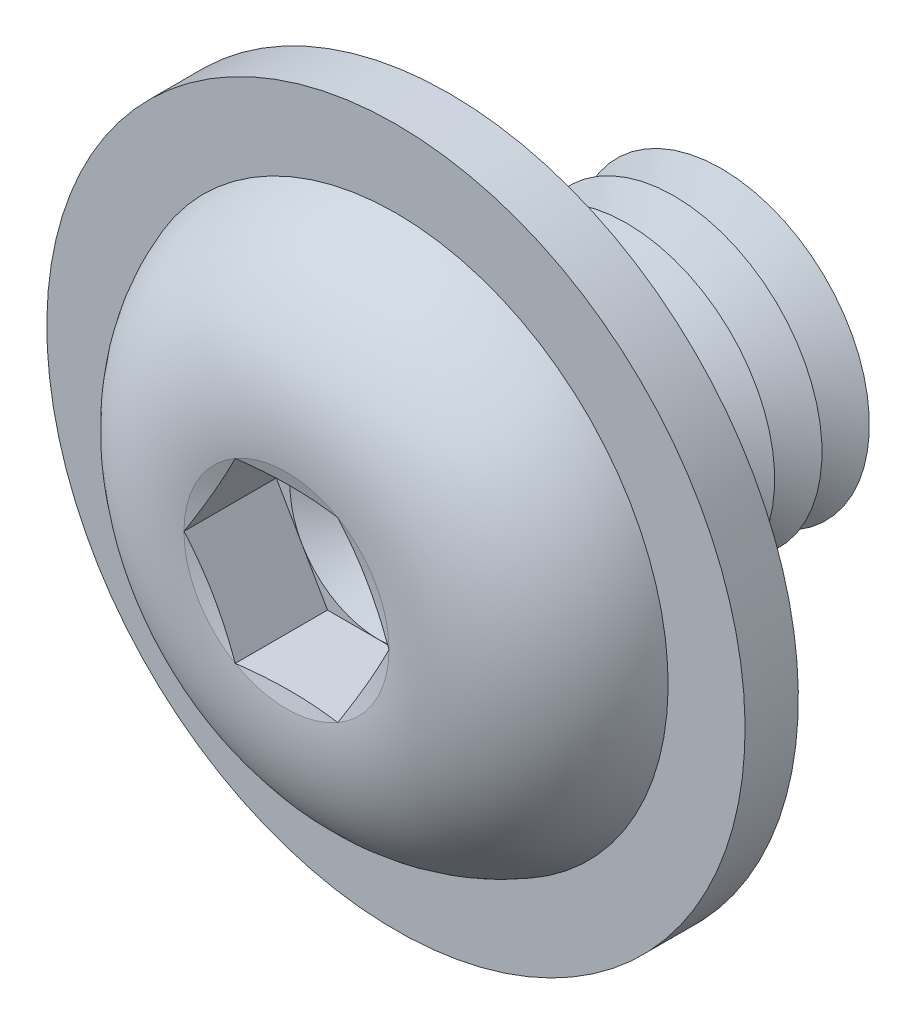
ISO-10303-21;
HEADER;
FILE_DESCRIPTION(('STEP AP214'),'2;1');
FILE_NAME('part.step','',(''),(''),'','','');
FILE_SCHEMA(('AUTOMOTIVE_DESIGN { 1 0 10303 214 1 1 1 1 }'));
ENDSEC;
DATA;
#1=APPLICATION_CONTEXT('core data for automotive mechanical design processes');
#2=APPLICATION_PROTOCOL_DEFINITION('international standard','automotive_design',2000,#1);
#3=PRODUCT_CONTEXT('',#1,'mechanical');
#4=PRODUCT('Part','Part','',(#3));
#5=PRODUCT_RELATED_PRODUCT_CATEGORY('part','',(#4));
#6=PRODUCT_DEFINITION_FORMATION('','',#4);
#7=PRODUCT_DEFINITION_CONTEXT('part definition',#1,'design');
#8=PRODUCT_DEFINITION('design','',#6,#7);
#9=PRODUCT_DEFINITION_SHAPE('','',#8);
#10=(LENGTH_UNIT() NAMED_UNIT(*) SI_UNIT(.MILLI.,.METRE.));
#11=(NAMED_UNIT(*) PLANE_ANGLE_UNIT() SI_UNIT($,.RADIAN.));
#12=(NAMED_UNIT(*) SI_UNIT($,.STERADIAN.) SOLID_ANGLE_UNIT());
#13=UNCERTAINTY_MEASURE_WITH_UNIT(LENGTH_MEASURE(1.E-05),#10,'distance_accuracy_value','');
#14=(GEOMETRIC_REPRESENTATION_CONTEXT(3) GLOBAL_UNCERTAINTY_ASSIGNED_CONTEXT((#13)) GLOBAL_UNIT_ASSIGNED_CONTEXT((#10,
#11,#12)) REPRESENTATION_CONTEXT('',''));
#15=CARTESIAN_POINT('',(0.,0.,0.));
#16=DIRECTION('',(0.,0.,1.));
#17=DIRECTION('',(1.,0.,0.));
#18=AXIS2_PLACEMENT_3D('',#15,#16,#17);
#19=CARTESIAN_POINT('',(0.,0.,-2.19999999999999));
#20=DIRECTION('',(0.,0.,1.));
#21=DIRECTION('',(0.,-1.,0.));
#22=AXIS2_PLACEMENT_3D('',#19,#20,#21);
#23=CONICAL_SURFACE('',#22,2.49999999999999,1.0471975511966);
#24=CARTESIAN_POINT('',(0.,0.,-2.59999999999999));
#25=DIRECTION('',(0.,0.,1.));
#26=DIRECTION('',(0.,-1.,0.));
#27=AXIS2_PLACEMENT_3D('',#24,#25,#26);
#28=CIRCLE('',#27,1.80717967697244);
#29=CARTESIAN_POINT('',(0.,-1.80717967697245,-2.59999999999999));
#30=VERTEX_POINT('',#29);
#31=EDGE_CURVE('E257',#30,#30,#28,.T.);
#32=ORIENTED_EDGE('',*,*,#31,.T.);
#33=EDGE_LOOP('',(#32));
#34=FACE_BOUND('',#33,.T.);
#35=CARTESIAN_POINT('',(0.,0.,-2.2));
#36=DIRECTION('',(0.,0.,1.));
#37=DIRECTION('',(0.,-1.,0.));
#38=AXIS2_PLACEMENT_3D('',#35,#36,#37);
#39=CIRCLE('',#38,2.49999999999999);
#40=CARTESIAN_POINT('',(0.,-2.5,-2.2));
#41=VERTEX_POINT('',#40);
#42=EDGE_CURVE('E253',#41,#41,#39,.T.);
#43=ORIENTED_EDGE('',*,*,#42,.F.);
#44=EDGE_LOOP('',(#43));
#45=FACE_BOUND('',#44,.T.);
#46=ADVANCED_FACE('F39',(#34,#45),#23,.T.);
#47=CARTESIAN_POINT('',(0.,0.,-2.59999999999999));
#48=DIRECTION('',(0.,0.,-1.));
#49=DIRECTION('',(0.,1.,0.));
#50=AXIS2_PLACEMENT_3D('',#47,#48,#49);
#51=CONICAL_SURFACE('',#50,1.80717967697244,1.04719755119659);
#52=CARTESIAN_POINT('',(0.,0.,-3.));
#53=DIRECTION('',(0.,0.,1.));
#54=DIRECTION('',(0.,-1.,0.));
#55=AXIS2_PLACEMENT_3D('',#52,#53,#54);
#56=CIRCLE('',#55,2.49999999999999);
#57=CARTESIAN_POINT('',(0.,-2.5,-3.));
#58=VERTEX_POINT('',#57);
#59=EDGE_CURVE('E261',#58,#58,#56,.T.);
#60=ORIENTED_EDGE('',*,*,#59,.T.);
#61=EDGE_LOOP('',(#60));
#62=FACE_BOUND('',#61,.T.);
#63=ORIENTED_EDGE('',*,*,#31,.F.);
#64=EDGE_LOOP('',(#63));
#65=FACE_BOUND('',#64,.T.);
#66=ADVANCED_FACE('F381',(#62,#65),#51,.T.);
#67=CARTESIAN_POINT('',(0.,2.49999999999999,-4.99999999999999));
#68=DIRECTION('',(0.,0.,-1.));
#69=DIRECTION('',(0.,1.,0.));
#70=AXIS2_PLACEMENT_3D('',#67,#68,#69);
#71=PLANE('',#70);
#72=CARTESIAN_POINT('',(0.,0.,-4.99999999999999));
#73=DIRECTION('',(0.,0.,1.));
#74=DIRECTION('',(0.,-1.,0.));
#75=AXIS2_PLACEMENT_3D('',#72,#73,#74);
#76=CIRCLE('',#75,1.80717967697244);
#77=CARTESIAN_POINT('',(0.,-1.80717967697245,-4.99999999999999));
#78=VERTEX_POINT('',#77);
#79=EDGE_CURVE('E281',#78,#78,#76,.T.);
#80=ORIENTED_EDGE('',*,*,#79,.F.);
#81=EDGE_LOOP('',(#80));
#82=FACE_BOUND('',#81,.T.);
#83=ADVANCED_FACE('F387',(#82),#71,.T.);
#84=CARTESIAN_POINT('',(0.,0.,-4.59999999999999));
#85=DIRECTION('',(0.,0.,1.));
#86=DIRECTION('',(0.,-1.,0.));
#87=AXIS2_PLACEMENT_3D('',#84,#85,#86);
#88=CONICAL_SURFACE('',#87,2.49999999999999,1.0471975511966);
#89=ORIENTED_EDGE('',*,*,#79,.T.);
#90=EDGE_LOOP('',(#89));
#91=FACE_BOUND('',#90,.T.);
#92=CARTESIAN_POINT('',(0.,0.,-4.6));
#93=DIRECTION('',(0.,0.,1.));
#94=DIRECTION('',(0.,-1.,0.));
#95=AXIS2_PLACEMENT_3D('',#92,#93,#94);
#96=CIRCLE('',#95,2.49999999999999);
#97=CARTESIAN_POINT('',(0.,-2.5,-4.6));
#98=VERTEX_POINT('',#97);
#99=EDGE_CURVE('E277',#98,#98,#96,.T.);
#100=ORIENTED_EDGE('',*,*,#99,.F.);
#101=EDGE_LOOP('',(#100));
#102=FACE_BOUND('',#101,.T.);
#103=ADVANCED_FACE('F406',(#91,#102),#88,.T.);
#104=CARTESIAN_POINT('',(0.,0.,-4.19999999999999));
#105=DIRECTION('',(0.,0.,-1.));
#106=DIRECTION('',(0.,1.,0.));
#107=AXIS2_PLACEMENT_3D('',#104,#105,#106);
#108=CONICAL_SURFACE('',#107,1.80717967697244,1.04719755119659);
#109=ORIENTED_EDGE('',*,*,#99,.T.);
#110=EDGE_LOOP('',(#109));
#111=FACE_BOUND('',#110,.T.);
#112=CARTESIAN_POINT('',(0.,0.,-4.19999999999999));
#113=DIRECTION('',(0.,0.,1.));
#114=DIRECTION('',(0.,-1.,0.));
#115=AXIS2_PLACEMENT_3D('',#112,#113,#114);
#116=CIRCLE('',#115,1.80717967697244);
#117=CARTESIAN_POINT('',(0.,-1.80717967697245,-4.19999999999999));
#118=VERTEX_POINT('',#117);
#119=EDGE_CURVE('E273',#118,#118,#116,.T.);
#120=ORIENTED_EDGE('',*,*,#119,.F.);
#121=EDGE_LOOP('',(#120));
#122=FACE_BOUND('',#121,.T.);
#123=ADVANCED_FACE('F403',(#111,#122),#108,.T.);
#124=CARTESIAN_POINT('',(0.,0.,-3.79999999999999));
#125=DIRECTION('',(0.,0.,1.));
#126=DIRECTION('',(0.,-1.,0.));
#127=AXIS2_PLACEMENT_3D('',#124,#125,#126);
#128=CONICAL_SURFACE('',#127,2.49999999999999,1.0471975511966);
#129=ORIENTED_EDGE('',*,*,#119,.T.);
#130=EDGE_LOOP('',(#129));
#131=FACE_BOUND('',#130,.T.);
#132=CARTESIAN_POINT('',(0.,0.,-3.8));
#133=DIRECTION('',(0.,0.,1.));
#134=DIRECTION('',(0.,-1.,0.));
#135=AXIS2_PLACEMENT_3D('',#132,#133,#134);
#136=CIRCLE('',#135,2.49999999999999);
#137=CARTESIAN_POINT('',(0.,-2.5,-3.8));
#138=VERTEX_POINT('',#137);
#139=EDGE_CURVE('E269',#138,#138,#136,.T.);
#140=ORIENTED_EDGE('',*,*,#139,.F.);
#141=EDGE_LOOP('',(#140));
#142=FACE_BOUND('',#141,.T.);
#143=ADVANCED_FACE('F397',(#131,#142),#128,.T.);
#144=CARTESIAN_POINT('',(0.,0.,-3.39999999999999));
#145=DIRECTION('',(0.,0.,-1.));
#146=DIRECTION('',(0.,1.,0.));
#147=AXIS2_PLACEMENT_3D('',#144,#145,#146);
#148=CONICAL_SURFACE('',#147,1.80717967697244,1.04719755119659);
#149=ORIENTED_EDGE('',*,*,#139,.T.);
#150=EDGE_LOOP('',(#149));
#151=FACE_BOUND('',#150,.T.);
#152=CARTESIAN_POINT('',(0.,0.,-3.39999999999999));
#153=DIRECTION('',(0.,0.,1.));
#154=DIRECTION('',(0.,-1.,0.));
#155=AXIS2_PLACEMENT_3D('',#152,#153,#154);
#156=CIRCLE('',#155,1.80717967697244);
#157=CARTESIAN_POINT('',(0.,-1.80717967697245,-3.39999999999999));
#158=VERTEX_POINT('',#157);
#159=EDGE_CURVE('E265',#158,#158,#156,.T.);
#160=ORIENTED_EDGE('',*,*,#159,.F.);
#161=EDGE_LOOP('',(#160));
#162=FACE_BOUND('',#161,.T.);
#163=ADVANCED_FACE('F393',(#151,#162),#148,.T.);
#164=CARTESIAN_POINT('',(0.,0.,-2.99999999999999));
#165=DIRECTION('',(0.,0.,1.));
#166=DIRECTION('',(0.,-1.,0.));
#167=AXIS2_PLACEMENT_3D('',#164,#165,#166);
#168=CONICAL_SURFACE('',#167,2.49999999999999,1.0471975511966);
#169=ORIENTED_EDGE('',*,*,#159,.T.);
#170=EDGE_LOOP('',(#169));
#171=FACE_BOUND('',#170,.T.);
#172=ORIENTED_EDGE('',*,*,#59,.F.);
#173=EDGE_LOOP('',(#172));
#174=FACE_BOUND('',#173,.T.);
#175=ADVANCED_FACE('F396',(#171,#174),#168,.T.);
#176=CARTESIAN_POINT('',(0.,0.,-1.39999999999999));
#177=DIRECTION('',(0.,0.,1.));
#178=DIRECTION('',(0.,-1.,0.));
#179=AXIS2_PLACEMENT_3D('',#176,#177,#178);
#180=CONICAL_SURFACE('',#179,2.49999999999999,1.0471975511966);
#181=CARTESIAN_POINT('',(0.,0.,-1.79999999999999));
#182=DIRECTION('',(0.,0.,1.));
#183=DIRECTION('',(0.,-1.,0.));
#184=AXIS2_PLACEMENT_3D('',#181,#182,#183);
#185=CIRCLE('',#184,1.80717967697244);
#186=CARTESIAN_POINT('',(0.,-1.80717967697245,-1.79999999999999));
#187=VERTEX_POINT('',#186);
#188=EDGE_CURVE('E249',#187,#187,#185,.T.);
#189=ORIENTED_EDGE('',*,*,#188,.T.);
#190=EDGE_LOOP('',(#189));
#191=FACE_BOUND('',#190,.T.);
#192=CARTESIAN_POINT('',(0.,0.,-1.4));
#193=DIRECTION('',(0.,0.,1.));
#194=DIRECTION('',(0.,-1.,0.));
#195=AXIS2_PLACEMENT_3D('',#192,#193,#194);
#196=CIRCLE('',#195,2.49999999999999);
#197=CARTESIAN_POINT('',(0.,-2.5,-1.4));
#198=VERTEX_POINT('',#197);
#199=EDGE_CURVE('E241',#198,#198,#196,.T.);
#200=ORIENTED_EDGE('',*,*,#199,.F.);
#201=EDGE_LOOP('',(#200));
#202=FACE_BOUND('',#201,.T.);
#203=ADVANCED_FACE('F401',(#191,#202),#180,.T.);
#204=CARTESIAN_POINT('',(0.,0.,-1.79999999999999));
#205=DIRECTION('',(0.,0.,-1.));
#206=DIRECTION('',(0.,1.,0.));
#207=AXIS2_PLACEMENT_3D('',#204,#205,#206);
#208=CONICAL_SURFACE('',#207,1.80717967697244,1.04719755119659);
#209=ORIENTED_EDGE('',*,*,#42,.T.);
#210=EDGE_LOOP('',(#209));
#211=FACE_BOUND('',#210,.T.);
#212=ORIENTED_EDGE('',*,*,#188,.F.);
#213=EDGE_LOOP('',(#212));
#214=FACE_BOUND('',#213,.T.);
#215=ADVANCED_FACE('F452',(#211,#214),#208,.T.);
#216=CARTESIAN_POINT('',(0.,0.,-0.599999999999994));
#217=DIRECTION('',(0.,0.,1.));
#218=DIRECTION('',(0.,-1.,0.));
#219=AXIS2_PLACEMENT_3D('',#216,#217,#218);
#220=CONICAL_SURFACE('',#219,2.49999999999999,1.0471975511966);
#221=CARTESIAN_POINT('',(0.,0.,-0.999999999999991));
#222=DIRECTION('',(0.,0.,1.));
#223=DIRECTION('',(0.,-1.,0.));
#224=AXIS2_PLACEMENT_3D('',#221,#222,#223);
#225=CIRCLE('',#224,1.80717967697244);
#226=CARTESIAN_POINT('',(0.,-1.80717967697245,-0.999999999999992));
#227=VERTEX_POINT('',#226);
#228=EDGE_CURVE('E230',#227,#227,#225,.T.);
#229=ORIENTED_EDGE('',*,*,#228,.T.);
#230=EDGE_LOOP('',(#229));
#231=FACE_BOUND('',#230,.T.);
#232=CARTESIAN_POINT('',(0.,0.,-0.599999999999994));
#233=DIRECTION('',(0.,0.,1.));
#234=DIRECTION('',(0.,-1.,0.));
#235=AXIS2_PLACEMENT_3D('',#232,#233,#234);
#236=CIRCLE('',#235,2.49999999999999);
#237=CARTESIAN_POINT('',(0.,-2.5,-0.599999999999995));
#238=VERTEX_POINT('',#237);
#239=EDGE_CURVE('E245',#238,#238,#236,.T.);
#240=ORIENTED_EDGE('',*,*,#239,.F.);
#241=EDGE_LOOP('',(#240));
#242=FACE_BOUND('',#241,.T.);
#243=ADVANCED_FACE('F458',(#231,#242),#220,.T.);
#244=CARTESIAN_POINT('',(0.,0.,-0.999999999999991));
#245=DIRECTION('',(0.,0.,-1.));
#246=DIRECTION('',(0.,1.,0.));
#247=AXIS2_PLACEMENT_3D('',#244,#245,#246);
#248=CONICAL_SURFACE('',#247,1.80717967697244,1.04719755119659);
#249=ORIENTED_EDGE('',*,*,#199,.T.);
#250=EDGE_LOOP('',(#249));
#251=FACE_BOUND('',#250,.T.);
#252=ORIENTED_EDGE('',*,*,#228,.F.);
#253=EDGE_LOOP('',(#252));
#254=FACE_BOUND('',#253,.T.);
#255=ADVANCED_FACE('F219',(#251,#254),#248,.T.);
#256=CARTESIAN_POINT('',(0.,2.49999999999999,0.));
#257=DIRECTION('',(0.,0.,-1.));
#258=DIRECTION('',(0.,1.,0.));
#259=AXIS2_PLACEMENT_3D('',#256,#257,#258);
#260=PLANE('',#259);
#261=CARTESIAN_POINT('',(0.,0.,0.));
#262=DIRECTION('',(0.,0.,-1.));
#263=DIRECTION('',(0.,1.,0.));
#264=AXIS2_PLACEMENT_3D('',#261,#262,#263);
#265=CIRCLE('',#264,2.89999999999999);
#266=CARTESIAN_POINT('',(0.,2.89999999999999,0.));
#267=VERTEX_POINT('',#266);
#268=EDGE_CURVE('E295',#267,#267,#265,.F.);
#269=ORIENTED_EDGE('',*,*,#268,.T.);
#270=EDGE_LOOP('',(#269));
#271=FACE_BOUND('',#270,.T.);
#272=CARTESIAN_POINT('',(0.,0.,0.));
#273=DIRECTION('',(0.,0.,-1.));
#274=DIRECTION('',(0.,1.,0.));
#275=AXIS2_PLACEMENT_3D('',#272,#273,#274);
#276=CIRCLE('',#275,5.9);
#277=CARTESIAN_POINT('',(0.,5.9,0.));
#278=VERTEX_POINT('',#277);
#279=EDGE_CURVE('E739',#278,#278,#276,.T.);
#280=ORIENTED_EDGE('',*,*,#279,.T.);
#281=EDGE_LOOP('',(#280));
#282=FACE_BOUND('',#281,.T.);
#283=ADVANCED_FACE('F470',(#271,#282),#260,.T.);
#284=CARTESIAN_POINT('',(0.,0.,-0.400000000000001));
#285=DIRECTION('',(0.,0.,-1.));
#286=DIRECTION('',(0.,1.,0.));
#287=AXIS2_PLACEMENT_3D('',#284,#285,#286);
#288=TOROIDAL_SURFACE('',#287,2.89999999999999,0.4);
#289=ORIENTED_EDGE('',*,*,#268,.F.);
#290=EDGE_LOOP('',(#289));
#291=FACE_BOUND('',#290,.T.);
#292=CARTESIAN_POINT('',(0.,0.,-0.400000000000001));
#293=DIRECTION('',(0.,0.,-1.));
#294=DIRECTION('',(0.,1.,0.));
#295=AXIS2_PLACEMENT_3D('',#292,#293,#294);
#296=CIRCLE('',#295,2.49999999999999);
#297=CARTESIAN_POINT('',(0.,2.49999999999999,-0.4));
#298=VERTEX_POINT('',#297);
#299=EDGE_CURVE('E290',#298,#298,#296,.T.);
#300=ORIENTED_EDGE('',*,*,#299,.F.);
#301=EDGE_LOOP('',(#300));
#302=FACE_BOUND('',#301,.T.);
#303=ADVANCED_FACE('F41',(#291,#302),#288,.F.);
#304=CARTESIAN_POINT('',(0.,0.,-4.99999999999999));
#305=DIRECTION('',(0.,0.,-1.));
#306=DIRECTION('',(0.,1.,0.));
#307=AXIS2_PLACEMENT_3D('',#304,#305,#306);
#308=CYLINDRICAL_SURFACE('',#307,2.49999999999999);
#309=ORIENTED_EDGE('',*,*,#299,.T.);
#310=EDGE_LOOP('',(#309));
#311=FACE_BOUND('',#310,.T.);
#312=ORIENTED_EDGE('',*,*,#239,.T.);
#313=EDGE_LOOP('',(#312));
#314=FACE_BOUND('',#313,.T.);
#315=ADVANCED_FACE('F482',(#311,#314),#308,.T.);
#316=CARTESIAN_POINT('',(0.,0.,0.9));
#317=DIRECTION('',(0.,0.,-1.));
#318=DIRECTION('',(0.,1.,0.));
#319=AXIS2_PLACEMENT_3D('',#316,#317,#318);
#320=CYLINDRICAL_SURFACE('',#319,5.9);
#321=CARTESIAN_POINT('',(0.,0.,0.9));
#322=DIRECTION('',(0.,0.,-1.));
#323=DIRECTION('',(0.,1.,0.));
#324=AXIS2_PLACEMENT_3D('',#321,#322,#323);
#325=CIRCLE('',#324,5.9);
#326=CARTESIAN_POINT('',(0.,5.9,0.9));
#327=VERTEX_POINT('',#326);
#328=EDGE_CURVE('E747',#327,#327,#325,.T.);
#329=ORIENTED_EDGE('',*,*,#328,.T.);
#330=EDGE_LOOP('',(#329));
#331=FACE_BOUND('',#330,.T.);
#332=ORIENTED_EDGE('',*,*,#279,.F.);
#333=EDGE_LOOP('',(#332));
#334=FACE_BOUND('',#333,.T.);
#335=ADVANCED_FACE('F488',(#331,#334),#320,.T.);
#336=CARTESIAN_POINT('',(0.,0.,0.9));
#337=DIRECTION('',(0.,0.,-1.));
#338=DIRECTION('',(0.,1.,0.));
#339=AXIS2_PLACEMENT_3D('',#336,#337,#338);
#340=PLANE('',#339);
#341=CARTESIAN_POINT('',(0.,0.,0.9));
#342=DIRECTION('',(0.,0.,-1.));
#343=DIRECTION('',(0.,1.,0.));
#344=AXIS2_PLACEMENT_3D('',#341,#342,#343);
#345=CIRCLE('',#344,4.59924727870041);
#346=CARTESIAN_POINT('',(0.,4.5992472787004,0.9));
#347=VERTEX_POINT('',#346);
#348=EDGE_CURVE('E43',#347,#347,#345,.F.);
#349=ORIENTED_EDGE('',*,*,#348,.F.);
#350=EDGE_LOOP('',(#349));
#351=FACE_BOUND('',#350,.T.);
#352=ORIENTED_EDGE('',*,*,#328,.F.);
#353=EDGE_LOOP('',(#352));
#354=FACE_BOUND('',#353,.T.);
#355=ADVANCED_FACE('F117',(#351,#354),#340,.F.);
#356=CARTESIAN_POINT('',(0.,0.,1.19));
#357=DIRECTION('',(0.,0.,1.));
#358=DIRECTION('',(1.,0.,0.));
#359=AXIS2_PLACEMENT_3D('',#356,#357,#358);
#360=CONICAL_SURFACE('',#359,1.49999930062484,1.0471975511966);
#361=CARTESIAN_POINT('',(0.,0.,0.323975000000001));
#362=VERTEX_POINT('',#361);
#363=VERTEX_LOOP('',#362);
#364=FACE_BOUND('',#363,.T.);
#365=CARTESIAN_POINT('',(0.,0.,1.19));
#366=DIRECTION('',(0.,0.,1.));
#367=DIRECTION('',(1.,0.,0.));
#368=AXIS2_PLACEMENT_3D('',#365,#366,#367);
#369=CIRCLE('',#368,1.49999930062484);
#370=CARTESIAN_POINT('',(1.2990375,0.749999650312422,1.19));
#371=VERTEX_POINT('',#370);
#372=CARTESIAN_POINT('',(0.,1.49999930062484,1.19));
#373=VERTEX_POINT('',#372);
#374=EDGE_CURVE('E120',#371,#373,#369,.T.);
#375=ORIENTED_EDGE('',*,*,#374,.T.);
#376=CARTESIAN_POINT('',(0.,0.,1.19));
#377=DIRECTION('',(0.,0.,1.));
#378=DIRECTION('',(1.,0.,0.));
#379=AXIS2_PLACEMENT_3D('',#376,#377,#378);
#380=CIRCLE('',#379,1.49999930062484);
#381=CARTESIAN_POINT('',(-1.2990375,0.749999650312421,1.19));
#382=VERTEX_POINT('',#381);
#383=EDGE_CURVE('E11',#373,#382,#380,.T.);
#384=ORIENTED_EDGE('',*,*,#383,.T.);
#385=CARTESIAN_POINT('',(-1.2990375,-0.749999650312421,1.19));
#386=VERTEX_POINT('',#385);
#387=EDGE_CURVE('E49',#382,#386,#380,.T.);
#388=ORIENTED_EDGE('',*,*,#387,.T.);
#389=CARTESIAN_POINT('',(0.,-1.49999930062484,1.19));
#390=VERTEX_POINT('',#389);
#391=EDGE_CURVE('E301',#386,#390,#380,.T.);
#392=ORIENTED_EDGE('',*,*,#391,.T.);
#393=CARTESIAN_POINT('',(1.29903750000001,-0.749999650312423,1.19));
#394=VERTEX_POINT('',#393);
#395=EDGE_CURVE('E57',#390,#394,#380,.T.);
#396=ORIENTED_EDGE('',*,*,#395,.T.);
#397=EDGE_CURVE('E50',#394,#371,#380,.T.);
#398=ORIENTED_EDGE('',*,*,#397,.T.);
#399=EDGE_LOOP('',(#375,#384,#388,#392,#396,#398));
#400=FACE_BOUND('',#399,.T.);
#401=ADVANCED_FACE('F114',(#364,#400),#360,.F.);
#402=CARTESIAN_POINT('',(0.,0.,1.19));
#403=DIRECTION('',(0.,0.,1.));
#404=DIRECTION('',(1.,0.,0.));
#405=AXIS2_PLACEMENT_3D('',#402,#403,#404);
#406=PLANE('',#405);
#407=ORIENTED_EDGE('',*,*,#383,.F.);
#408=DIRECTION('',(-1.,0.,0.));
#409=VECTOR('',#408,1.);
#410=CARTESIAN_POINT('',(0.866025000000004,1.49999930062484,1.19));
#411=LINE('',#410,#409);
#412=CARTESIAN_POINT('',(-0.866025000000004,1.49999930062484,1.19));
#413=VERTEX_POINT('',#412);
#414=EDGE_CURVE('E132',#373,#413,#411,.T.);
#415=ORIENTED_EDGE('',*,*,#414,.T.);
#416=DIRECTION('',(-0.5,-0.866025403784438,0.));
#417=VECTOR('',#416,1.);
#418=CARTESIAN_POINT('',(-0.866025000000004,1.49999930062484,1.19));
#419=LINE('',#418,#417);
#420=EDGE_CURVE('E135',#413,#382,#419,.T.);
#421=ORIENTED_EDGE('',*,*,#420,.T.);
#422=EDGE_LOOP('',(#407,#415,#421));
#423=FACE_BOUND('',#422,.T.);
#424=ADVANCED_FACE('F116',(#423),#406,.T.);
#425=ORIENTED_EDGE('',*,*,#387,.F.);
#426=CARTESIAN_POINT('',(-1.73205000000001,0.,1.19));
#427=VERTEX_POINT('',#426);
#428=EDGE_CURVE('E145',#382,#427,#419,.T.);
#429=ORIENTED_EDGE('',*,*,#428,.T.);
#430=DIRECTION('',(0.5,-0.866025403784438,0.));
#431=VECTOR('',#430,1.);
#432=CARTESIAN_POINT('',(-1.73205000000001,0.,1.19));
#433=LINE('',#432,#431);
#434=EDGE_CURVE('E153',#427,#386,#433,.T.);
#435=ORIENTED_EDGE('',*,*,#434,.T.);
#436=EDGE_LOOP('',(#425,#429,#435));
#437=FACE_BOUND('',#436,.T.);
#438=ADVANCED_FACE('F316',(#437),#406,.T.);
#439=ORIENTED_EDGE('',*,*,#391,.F.);
#440=CARTESIAN_POINT('',(-0.866025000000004,-1.49999930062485,1.19));
#441=VERTEX_POINT('',#440);
#442=EDGE_CURVE('E152',#386,#441,#433,.T.);
#443=ORIENTED_EDGE('',*,*,#442,.T.);
#444=DIRECTION('',(1.,0.,0.));
#445=VECTOR('',#444,1.);
#446=CARTESIAN_POINT('',(-0.866025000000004,-1.49999930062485,1.19));
#447=LINE('',#446,#445);
#448=EDGE_CURVE('E158',#441,#390,#447,.T.);
#449=ORIENTED_EDGE('',*,*,#448,.T.);
#450=EDGE_LOOP('',(#439,#443,#449));
#451=FACE_BOUND('',#450,.T.);
#452=ADVANCED_FACE('F309',(#451),#406,.T.);
#453=ORIENTED_EDGE('',*,*,#395,.F.);
#454=CARTESIAN_POINT('',(0.866025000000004,-1.49999930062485,1.19));
#455=VERTEX_POINT('',#454);
#456=EDGE_CURVE('E157',#390,#455,#447,.T.);
#457=ORIENTED_EDGE('',*,*,#456,.T.);
#458=DIRECTION('',(0.5,0.866025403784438,0.));
#459=VECTOR('',#458,1.);
#460=CARTESIAN_POINT('',(0.866025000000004,-1.49999930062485,1.19));
#461=LINE('',#460,#459);
#462=EDGE_CURVE('E163',#455,#394,#461,.T.);
#463=ORIENTED_EDGE('',*,*,#462,.T.);
#464=EDGE_LOOP('',(#453,#457,#463));
#465=FACE_BOUND('',#464,.T.);
#466=ADVANCED_FACE('F517',(#465),#406,.T.);
#467=ORIENTED_EDGE('',*,*,#397,.F.);
#468=CARTESIAN_POINT('',(1.73205000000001,0.,1.19));
#469=VERTEX_POINT('',#468);
#470=EDGE_CURVE('E162',#394,#469,#461,.T.);
#471=ORIENTED_EDGE('',*,*,#470,.T.);
#472=DIRECTION('',(-0.5,0.866025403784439,0.));
#473=VECTOR('',#472,1.);
#474=CARTESIAN_POINT('',(1.73205000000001,0.,1.19));
#475=LINE('',#474,#473);
#476=EDGE_CURVE('E141',#469,#371,#475,.T.);
#477=ORIENTED_EDGE('',*,*,#476,.T.);
#478=EDGE_LOOP('',(#467,#471,#477));
#479=FACE_BOUND('',#478,.T.);
#480=ADVANCED_FACE('F522',(#479),#406,.T.);
#481=ORIENTED_EDGE('',*,*,#374,.F.);
#482=CARTESIAN_POINT('',(0.866025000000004,1.49999930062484,1.19));
#483=VERTEX_POINT('',#482);
#484=EDGE_CURVE('E127',#371,#483,#475,.T.);
#485=ORIENTED_EDGE('',*,*,#484,.T.);
#486=EDGE_CURVE('E137',#483,#373,#411,.T.);
#487=ORIENTED_EDGE('',*,*,#486,.T.);
#488=EDGE_LOOP('',(#481,#485,#487));
#489=FACE_BOUND('',#488,.T.);
#490=ADVANCED_FACE('F143',(#489),#406,.T.);
#491=CARTESIAN_POINT('',(0.866025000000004,1.49999930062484,1.19));
#492=DIRECTION('',(0.,1.,0.));
#493=DIRECTION('',(-1.,0.,0.));
#494=AXIS2_PLACEMENT_3D('',#491,#492,#493);
#495=PLANE('',#494);
#496=CARTESIAN_POINT('',(2.61375031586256,1.49999930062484,3.09338600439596));
#497=CARTESIAN_POINT('',(2.4871989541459,1.49999930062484,3.06401688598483));
#498=CARTESIAN_POINT('',(2.36054180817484,1.49999930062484,3.03507426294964));
#499=CARTESIAN_POINT('',(2.10688190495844,1.49999930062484,2.97862489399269));
#500=CARTESIAN_POINT('',(1.97987908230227,1.49999930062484,2.95111844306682));
#501=CARTESIAN_POINT('',(1.72425281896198,1.49999930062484,2.89788845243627));
#502=CARTESIAN_POINT('',(1.59562534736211,1.49999930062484,2.87218404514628));
#503=CARTESIAN_POINT('',(1.33776732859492,1.49999930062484,2.82387586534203));
#504=CARTESIAN_POINT('',(1.20853672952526,1.49999930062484,2.80127236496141));
#505=CARTESIAN_POINT('',(0.952831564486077,1.49999930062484,2.76126658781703));
#506=CARTESIAN_POINT('',(0.826376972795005,1.49999930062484,2.74374018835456));
#507=CARTESIAN_POINT('',(0.5727557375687,1.49999930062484,2.71502809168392));
#508=CARTESIAN_POINT('',(0.445589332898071,1.49999930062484,2.70384038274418));
#509=CARTESIAN_POINT('',(0.191333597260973,1.49999930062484,2.68972083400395));
#510=CARTESIAN_POINT('',(0.064246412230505,1.49999930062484,2.68675270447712));
#511=CARTESIAN_POINT('',(-0.189835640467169,1.49999930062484,2.68959577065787));
#512=CARTESIAN_POINT('',(-0.316830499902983,1.49999930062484,2.69540767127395));
#513=CARTESIAN_POINT('',(-0.534182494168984,1.49999930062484,2.71190493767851));
#514=CARTESIAN_POINT('',(-0.624691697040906,1.49999930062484,2.72073513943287));
#515=CARTESIAN_POINT('',(-0.805336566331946,1.49999930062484,2.74156379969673));
#516=CARTESIAN_POINT('',(-0.895472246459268,1.49999930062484,2.75356214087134));
#517=CARTESIAN_POINT('',(-1.07565729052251,1.49999930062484,2.78006977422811));
#518=CARTESIAN_POINT('',(-1.16570548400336,1.49999930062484,2.7945868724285));
#519=CARTESIAN_POINT('',(-1.34547871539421,1.49999930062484,2.82550612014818));
#520=CARTESIAN_POINT('',(-1.43520373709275,1.49999930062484,2.8419083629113));
#521=CARTESIAN_POINT('',(-1.61622412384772,1.49999930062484,2.87648604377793));
#522=CARTESIAN_POINT('',(-1.7075137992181,1.49999930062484,2.89469103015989));
#523=CARTESIAN_POINT('',(-1.88986344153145,1.49999930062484,2.93221618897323));
#524=CARTESIAN_POINT('',(-1.9809234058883,1.49999930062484,2.95153637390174));
#525=CARTESIAN_POINT('',(-2.1623635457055,1.49999930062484,2.99091506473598));
#526=CARTESIAN_POINT('',(-2.25274472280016,1.49999930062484,3.01096897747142));
#527=CARTESIAN_POINT('',(-2.43335289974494,1.49999930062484,3.05173139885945));
#528=CARTESIAN_POINT('',(-2.52357990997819,1.49999930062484,3.07243986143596));
#529=CARTESIAN_POINT('',(-2.61375031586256,1.49999930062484,3.09338600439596));
#530=B_SPLINE_CURVE_WITH_KNOTS('',3,(#496,#497,#498,#499,#500,#501,#502,#503,#504,#505,#506,
#507,#508,#509,#510,#511,#512,#513,#514,#515,#516,#517,#518,#519,#520,#521,#522,#523,#524,#525,
#526,#527,#528,#529),.UNSPECIFIED.,.F.,.F.,(4,2,2,2,2,2,2,2,2,2,2,2,2,2,2,2,4),(0.,
0.389753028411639,0.779585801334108,1.17307326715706,1.56659524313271,1.94947555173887,
2.33223427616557,2.71330039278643,3.0943971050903,3.36715350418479,3.63989980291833,
3.91350699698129,4.18712773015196,4.46638029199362,4.74563598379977,5.02337106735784,
5.30108664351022),.UNSPECIFIED.);
#531=CARTESIAN_POINT('',(0.866024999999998,1.49999930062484,2.75));
#532=VERTEX_POINT('',#531);
#533=CARTESIAN_POINT('',(-0.866025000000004,1.49999930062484,2.75));
#534=VERTEX_POINT('',#533);
#535=EDGE_CURVE('E171',#532,#534,#530,.T.);
#536=ORIENTED_EDGE('',*,*,#535,.T.);
#537=DIRECTION('',(0.,0.,1.));
#538=VECTOR('',#537,1.);
#539=CARTESIAN_POINT('',(-0.866025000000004,1.49999930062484,1.19));
#540=LINE('',#539,#538);
#541=EDGE_CURVE('E139',#413,#534,#540,.T.);
#542=ORIENTED_EDGE('',*,*,#541,.F.);
#543=ORIENTED_EDGE('',*,*,#414,.F.);
#544=ORIENTED_EDGE('',*,*,#486,.F.);
#545=DIRECTION('',(0.,0.,1.));
#546=VECTOR('',#545,1.);
#547=CARTESIAN_POINT('',(0.866025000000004,1.49999930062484,1.19));
#548=LINE('',#547,#546);
#549=EDGE_CURVE('E65',#483,#532,#548,.T.);
#550=ORIENTED_EDGE('',*,*,#549,.T.);
#551=EDGE_LOOP('',(#536,#542,#543,#544,#550));
#552=FACE_BOUND('',#551,.T.);
#553=ADVANCED_FACE('F136',(#552),#495,.F.);
#554=CARTESIAN_POINT('',(-0.866025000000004,1.49999930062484,1.19));
#555=DIRECTION('',(-0.866025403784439,0.5,0.));
#556=DIRECTION('',(-0.5,-0.866025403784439,0.));
#557=AXIS2_PLACEMENT_3D('',#554,#555,#556);
#558=PLANE('',#557);
#559=CARTESIAN_POINT('',(-0.865909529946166,1.50019930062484,2.75003094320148));
#560=CARTESIAN_POINT('',(-0.901882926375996,1.43789155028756,2.74038633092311));
#561=CARTESIAN_POINT('',(-0.937921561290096,1.37547080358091,2.73163050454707));
#562=CARTESIAN_POINT('',(-1.01012614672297,1.25040879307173,2.71624720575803));
#563=CARTESIAN_POINT('',(-1.0462921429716,1.18776745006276,2.70962059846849));
#564=CARTESIAN_POINT('',(-1.11853210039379,1.06264417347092,2.69888271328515));
#565=CARTESIAN_POINT('',(-1.15460557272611,1.00016308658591,2.69475862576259));
#566=CARTESIAN_POINT('',(-1.22679853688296,0.875121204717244,2.68922863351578));
#567=CARTESIAN_POINT('',(-1.26291801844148,0.812560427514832,2.68782220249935));
#568=CARTESIAN_POINT('',(-1.33515698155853,0.687438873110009,2.68782220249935));
#569=CARTESIAN_POINT('',(-1.37127646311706,0.624878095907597,2.68922863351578));
#570=CARTESIAN_POINT('',(-1.44346942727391,0.499836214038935,2.69475862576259));
#571=CARTESIAN_POINT('',(-1.47954289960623,0.437355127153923,2.69888271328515));
#572=CARTESIAN_POINT('',(-1.55178285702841,0.312231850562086,2.70962059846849));
#573=CARTESIAN_POINT('',(-1.58794885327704,0.249590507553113,2.71624720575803));
#574=CARTESIAN_POINT('',(-1.66015343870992,0.124528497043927,2.73163050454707));
#575=CARTESIAN_POINT('',(-1.69619207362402,0.0621077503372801,2.74038633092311));
#576=CARTESIAN_POINT('',(-1.73216547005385,-0.000200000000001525,2.75003094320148));
#577=B_SPLINE_CURVE_WITH_KNOTS('',3,(#559,#560,#561,#562,#563,#564,#565,#566,#567,#568,#569,
#570,#571,#572,#573,#574,#575,#576),.UNSPECIFIED.,.F.,.F.,(4,2,2,2,2,2,2,2,4),(0.,
0.217782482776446,0.435653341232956,0.65239936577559,0.869103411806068,1.08580745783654,
1.30255348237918,1.52042434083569,1.73820682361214),.UNSPECIFIED.);
#578=CARTESIAN_POINT('',(-1.73205000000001,0.,2.75));
#579=VERTEX_POINT('',#578);
#580=EDGE_CURVE('E196',#534,#579,#577,.T.);
#581=ORIENTED_EDGE('',*,*,#580,.T.);
#582=DIRECTION('',(0.,0.,1.));
#583=VECTOR('',#582,1.);
#584=CARTESIAN_POINT('',(-1.73205000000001,0.,1.19));
#585=LINE('',#584,#583);
#586=EDGE_CURVE('E180',#427,#579,#585,.T.);
#587=ORIENTED_EDGE('',*,*,#586,.F.);
#588=ORIENTED_EDGE('',*,*,#428,.F.);
#589=ORIENTED_EDGE('',*,*,#420,.F.);
#590=ORIENTED_EDGE('',*,*,#541,.T.);
#591=EDGE_LOOP('',(#581,#587,#588,#589,#590));
#592=FACE_BOUND('',#591,.T.);
#593=ADVANCED_FACE('F210',(#592),#558,.F.);
#594=CARTESIAN_POINT('',(-1.73205000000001,0.,1.19));
#595=DIRECTION('',(-0.866025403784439,-0.5,0.));
#596=DIRECTION('',(0.5,-0.866025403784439,0.));
#597=AXIS2_PLACEMENT_3D('',#594,#595,#596);
#598=PLANE('',#597);
#599=CARTESIAN_POINT('',(-1.73216547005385,0.000199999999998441,2.75003094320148));
#600=CARTESIAN_POINT('',(-1.69619207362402,-0.0621077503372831,2.74038633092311));
#601=CARTESIAN_POINT('',(-1.66015343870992,-0.12452849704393,2.73163050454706));
#602=CARTESIAN_POINT('',(-1.58794885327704,-0.249590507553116,2.71624720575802));
#603=CARTESIAN_POINT('',(-1.55178285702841,-0.312231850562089,2.70962059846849));
#604=CARTESIAN_POINT('',(-1.47954289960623,-0.437355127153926,2.69888271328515));
#605=CARTESIAN_POINT('',(-1.44346942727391,-0.499836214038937,2.69475862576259));
#606=CARTESIAN_POINT('',(-1.37127646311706,-0.6248780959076,2.68922863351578));
#607=CARTESIAN_POINT('',(-1.33515698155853,-0.687438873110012,2.68782220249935));
#608=CARTESIAN_POINT('',(-1.26291801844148,-0.812560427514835,2.68782220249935));
#609=CARTESIAN_POINT('',(-1.22679853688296,-0.875121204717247,2.68922863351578));
#610=CARTESIAN_POINT('',(-1.15460557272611,-1.00016308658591,2.69475862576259));
#611=CARTESIAN_POINT('',(-1.11853210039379,-1.06264417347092,2.69888271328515));
#612=CARTESIAN_POINT('',(-1.0462921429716,-1.18776745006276,2.70962059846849));
#613=CARTESIAN_POINT('',(-1.01012614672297,-1.25040879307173,2.71624720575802));
#614=CARTESIAN_POINT('',(-0.937921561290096,-1.37547080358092,2.73163050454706));
#615=CARTESIAN_POINT('',(-0.901882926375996,-1.43789155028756,2.7403863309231));
#616=CARTESIAN_POINT('',(-0.865909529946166,-1.50019930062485,2.75003094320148));
#617=B_SPLINE_CURVE_WITH_KNOTS('',3,(#599,#600,#601,#602,#603,#604,#605,#606,#607,#608,#609,
#610,#611,#612,#613,#614,#615,#616),.UNSPECIFIED.,.F.,.F.,(4,2,2,2,2,2,2,2,4),(0.,
0.217782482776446,0.435653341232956,0.65239936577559,0.869103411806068,1.08580745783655,
1.30255348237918,1.52042434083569,1.73820682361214),.UNSPECIFIED.);
#618=CARTESIAN_POINT('',(-0.866025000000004,-1.49999930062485,2.75));
#619=VERTEX_POINT('',#618);
#620=EDGE_CURVE('E321',#579,#619,#617,.T.);
#621=ORIENTED_EDGE('',*,*,#620,.T.);
#622=DIRECTION('',(0.,0.,1.));
#623=VECTOR('',#622,1.);
#624=CARTESIAN_POINT('',(-0.866025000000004,-1.49999930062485,1.19));
#625=LINE('',#624,#623);
#626=EDGE_CURVE('E176',#441,#619,#625,.T.);
#627=ORIENTED_EDGE('',*,*,#626,.F.);
#628=ORIENTED_EDGE('',*,*,#442,.F.);
#629=ORIENTED_EDGE('',*,*,#434,.F.);
#630=ORIENTED_EDGE('',*,*,#586,.T.);
#631=EDGE_LOOP('',(#621,#627,#628,#629,#630));
#632=FACE_BOUND('',#631,.T.);
#633=ADVANCED_FACE('F314',(#632),#598,.F.);
#634=CARTESIAN_POINT('',(-0.866025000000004,-1.49999930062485,1.19));
#635=DIRECTION('',(0.,-1.,0.));
#636=DIRECTION('',(0.,0.,-1.));
#637=AXIS2_PLACEMENT_3D('',#634,#635,#636);
#638=PLANE('',#637);
#639=CARTESIAN_POINT('',(-2.61375031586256,-1.49999930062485,3.09338600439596));
#640=CARTESIAN_POINT('',(-2.4871989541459,-1.49999930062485,3.06401688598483));
#641=CARTESIAN_POINT('',(-2.36054180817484,-1.49999930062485,3.03507426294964));
#642=CARTESIAN_POINT('',(-2.10688190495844,-1.49999930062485,2.97862489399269));
#643=CARTESIAN_POINT('',(-1.97987908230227,-1.49999930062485,2.95111844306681));
#644=CARTESIAN_POINT('',(-1.72425281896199,-1.49999930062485,2.89788845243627));
#645=CARTESIAN_POINT('',(-1.59562534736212,-1.49999930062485,2.87218404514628));
#646=CARTESIAN_POINT('',(-1.33776732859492,-1.49999930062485,2.82387586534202));
#647=CARTESIAN_POINT('',(-1.20853672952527,-1.49999930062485,2.80127236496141));
#648=CARTESIAN_POINT('',(-0.95283156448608,-1.49999930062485,2.76126658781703));
#649=CARTESIAN_POINT('',(-0.826376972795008,-1.49999930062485,2.74374018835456));
#650=CARTESIAN_POINT('',(-0.572755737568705,-1.49999930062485,2.71502809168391));
#651=CARTESIAN_POINT('',(-0.445589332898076,-1.49999930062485,2.70384038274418));
#652=CARTESIAN_POINT('',(-0.191333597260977,-1.49999930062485,2.68972083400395));
#653=CARTESIAN_POINT('',(-0.0642464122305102,-1.49999930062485,2.68675270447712));
#654=CARTESIAN_POINT('',(0.189835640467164,-1.49999930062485,2.68959577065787));
#655=CARTESIAN_POINT('',(0.316830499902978,-1.49999930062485,2.69540767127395));
#656=CARTESIAN_POINT('',(0.534182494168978,-1.49999930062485,2.71190493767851));
#657=CARTESIAN_POINT('',(0.6246916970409,-1.49999930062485,2.72073513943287));
#658=CARTESIAN_POINT('',(0.80533656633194,-1.49999930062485,2.74156379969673));
#659=CARTESIAN_POINT('',(0.895472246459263,-1.49999930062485,2.75356214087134));
#660=CARTESIAN_POINT('',(1.0756572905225,-1.49999930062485,2.7800697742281));
#661=CARTESIAN_POINT('',(1.16570548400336,-1.49999930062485,2.7945868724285));
#662=CARTESIAN_POINT('',(1.3454787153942,-1.49999930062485,2.82550612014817));
#663=CARTESIAN_POINT('',(1.43520373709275,-1.49999930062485,2.8419083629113));
#664=CARTESIAN_POINT('',(1.61622412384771,-1.49999930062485,2.87648604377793));
#665=CARTESIAN_POINT('',(1.7075137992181,-1.49999930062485,2.89469103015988));
#666=CARTESIAN_POINT('',(1.88986344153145,-1.49999930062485,2.93221618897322));
#667=CARTESIAN_POINT('',(1.9809234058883,-1.49999930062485,2.95153637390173));
#668=CARTESIAN_POINT('',(2.1623635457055,-1.49999930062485,2.99091506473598));
#669=CARTESIAN_POINT('',(2.25274472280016,-1.49999930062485,3.01096897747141));
#670=CARTESIAN_POINT('',(2.43335289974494,-1.49999930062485,3.05173139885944));
#671=CARTESIAN_POINT('',(2.52357990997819,-1.49999930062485,3.07243986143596));
#672=CARTESIAN_POINT('',(2.61375031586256,-1.49999930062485,3.09338600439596));
#673=B_SPLINE_CURVE_WITH_KNOTS('',3,(#639,#640,#641,#642,#643,#644,#645,#646,#647,#648,#649,
#650,#651,#652,#653,#654,#655,#656,#657,#658,#659,#660,#661,#662,#663,#664,#665,#666,#667,#668,
#669,#670,#671,#672),.UNSPECIFIED.,.F.,.F.,(4,2,2,2,2,2,2,2,2,2,2,2,2,2,2,2,4),(0.,
0.389753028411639,0.779585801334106,1.17307326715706,1.56659524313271,1.94947555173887,
2.33223427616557,2.71330039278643,3.09439710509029,3.36715350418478,3.63989980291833,
3.91350699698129,4.18712773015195,4.46638029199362,4.74563598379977,5.02337106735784,
5.30108664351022),.UNSPECIFIED.);
#674=CARTESIAN_POINT('',(0.866025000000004,-1.49999930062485,2.75));
#675=VERTEX_POINT('',#674);
#676=EDGE_CURVE('E330',#619,#675,#673,.T.);
#677=ORIENTED_EDGE('',*,*,#676,.T.);
#678=DIRECTION('',(0.,0.,1.));
#679=VECTOR('',#678,1.);
#680=CARTESIAN_POINT('',(0.866025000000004,-1.49999930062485,1.19));
#681=LINE('',#680,#679);
#682=EDGE_CURVE('E172',#455,#675,#681,.T.);
#683=ORIENTED_EDGE('',*,*,#682,.F.);
#684=ORIENTED_EDGE('',*,*,#456,.F.);
#685=ORIENTED_EDGE('',*,*,#448,.F.);
#686=ORIENTED_EDGE('',*,*,#626,.T.);
#687=EDGE_LOOP('',(#677,#683,#684,#685,#686));
#688=FACE_BOUND('',#687,.T.);
#689=ADVANCED_FACE('F370',(#688),#638,.F.);
#690=CARTESIAN_POINT('',(0.866025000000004,-1.49999930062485,1.19));
#691=DIRECTION('',(0.866025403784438,-0.5,0.));
#692=DIRECTION('',(0.5,0.866025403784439,0.));
#693=AXIS2_PLACEMENT_3D('',#690,#691,#692);
#694=PLANE('',#693);
#695=CARTESIAN_POINT('',(0.865909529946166,-1.50019930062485,2.75003094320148));
#696=CARTESIAN_POINT('',(0.901882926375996,-1.43789155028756,2.7403863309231));
#697=CARTESIAN_POINT('',(0.937921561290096,-1.37547080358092,2.73163050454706));
#698=CARTESIAN_POINT('',(1.01012614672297,-1.25040879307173,2.71624720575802));
#699=CARTESIAN_POINT('',(1.0462921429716,-1.18776745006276,2.70962059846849));
#700=CARTESIAN_POINT('',(1.11853210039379,-1.06264417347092,2.69888271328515));
#701=CARTESIAN_POINT('',(1.15460557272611,-1.00016308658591,2.69475862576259));
#702=CARTESIAN_POINT('',(1.22679853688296,-0.875121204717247,2.68922863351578));
#703=CARTESIAN_POINT('',(1.26291801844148,-0.812560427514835,2.68782220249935));
#704=CARTESIAN_POINT('',(1.33515698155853,-0.687438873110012,2.68782220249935));
#705=CARTESIAN_POINT('',(1.37127646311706,-0.6248780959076,2.68922863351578));
#706=CARTESIAN_POINT('',(1.44346942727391,-0.499836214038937,2.69475862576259));
#707=CARTESIAN_POINT('',(1.47954289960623,-0.437355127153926,2.69888271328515));
#708=CARTESIAN_POINT('',(1.55178285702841,-0.312231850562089,2.70962059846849));
#709=CARTESIAN_POINT('',(1.58794885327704,-0.249590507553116,2.71624720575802));
#710=CARTESIAN_POINT('',(1.66015343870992,-0.12452849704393,2.73163050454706));
#711=CARTESIAN_POINT('',(1.69619207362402,-0.062107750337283,2.74038633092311));
#712=CARTESIAN_POINT('',(1.73216547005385,0.000199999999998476,2.75003094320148));
#713=B_SPLINE_CURVE_WITH_KNOTS('',3,(#695,#696,#697,#698,#699,#700,#701,#702,#703,#704,#705,
#706,#707,#708,#709,#710,#711,#712),.UNSPECIFIED.,.F.,.F.,(4,2,2,2,2,2,2,2,4),(0.,
0.217782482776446,0.435653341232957,0.65239936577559,0.869103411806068,1.08580745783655,
1.30255348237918,1.52042434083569,1.73820682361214),.UNSPECIFIED.);
#714=CARTESIAN_POINT('',(1.73205000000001,0.,2.75));
#715=VERTEX_POINT('',#714);
#716=EDGE_CURVE('E231',#675,#715,#713,.T.);
#717=ORIENTED_EDGE('',*,*,#716,.T.);
#718=DIRECTION('',(0.,0.,1.));
#719=VECTOR('',#718,1.);
#720=CARTESIAN_POINT('',(1.73205000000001,0.,1.19));
#721=LINE('',#720,#719);
#722=EDGE_CURVE('E167',#469,#715,#721,.T.);
#723=ORIENTED_EDGE('',*,*,#722,.F.);
#724=ORIENTED_EDGE('',*,*,#470,.F.);
#725=ORIENTED_EDGE('',*,*,#462,.F.);
#726=ORIENTED_EDGE('',*,*,#682,.T.);
#727=EDGE_LOOP('',(#717,#723,#724,#725,#726));
#728=FACE_BOUND('',#727,.T.);
#729=ADVANCED_FACE('F217',(#728),#694,.F.);
#730=CARTESIAN_POINT('',(1.73205000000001,0.,1.19));
#731=DIRECTION('',(0.866025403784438,0.5,0.));
#732=DIRECTION('',(-0.5,0.866025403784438,0.));
#733=AXIS2_PLACEMENT_3D('',#730,#731,#732);
#734=PLANE('',#733);
#735=CARTESIAN_POINT('',(1.73216547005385,-0.000200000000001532,2.75003094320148));
#736=CARTESIAN_POINT('',(1.69619207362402,0.0621077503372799,2.74038633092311));
#737=CARTESIAN_POINT('',(1.66015343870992,0.124528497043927,2.73163050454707));
#738=CARTESIAN_POINT('',(1.58794885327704,0.249590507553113,2.71624720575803));
#739=CARTESIAN_POINT('',(1.55178285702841,0.312231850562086,2.70962059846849));
#740=CARTESIAN_POINT('',(1.47954289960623,0.437355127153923,2.69888271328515));
#741=CARTESIAN_POINT('',(1.44346942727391,0.499836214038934,2.69475862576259));
#742=CARTESIAN_POINT('',(1.37127646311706,0.624878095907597,2.68922863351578));
#743=CARTESIAN_POINT('',(1.33515698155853,0.687438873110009,2.68782220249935));
#744=CARTESIAN_POINT('',(1.26291801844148,0.812560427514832,2.68782220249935));
#745=CARTESIAN_POINT('',(1.22679853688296,0.875121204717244,2.68922863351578));
#746=CARTESIAN_POINT('',(1.15460557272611,1.00016308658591,2.69475862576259));
#747=CARTESIAN_POINT('',(1.11853210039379,1.06264417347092,2.69888271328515));
#748=CARTESIAN_POINT('',(1.0462921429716,1.18776745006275,2.70962059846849));
#749=CARTESIAN_POINT('',(1.01012614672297,1.25040879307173,2.71624720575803));
#750=CARTESIAN_POINT('',(0.937921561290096,1.37547080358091,2.73163050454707));
#751=CARTESIAN_POINT('',(0.901882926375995,1.43789155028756,2.74038633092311));
#752=CARTESIAN_POINT('',(0.865909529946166,1.50019930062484,2.75003094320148));
#753=B_SPLINE_CURVE_WITH_KNOTS('',3,(#735,#736,#737,#738,#739,#740,#741,#742,#743,#744,#745,
#746,#747,#748,#749,#750,#751,#752),.UNSPECIFIED.,.F.,.F.,(4,2,2,2,2,2,2,2,4),(0.,
0.217782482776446,0.435653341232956,0.65239936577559,0.869103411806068,1.08580745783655,
1.30255348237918,1.52042434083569,1.73820682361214),.UNSPECIFIED.);
#754=EDGE_CURVE('E222',#715,#532,#753,.T.);
#755=ORIENTED_EDGE('',*,*,#754,.T.);
#756=ORIENTED_EDGE('',*,*,#549,.F.);
#757=ORIENTED_EDGE('',*,*,#484,.F.);
#758=ORIENTED_EDGE('',*,*,#476,.F.);
#759=ORIENTED_EDGE('',*,*,#722,.T.);
#760=EDGE_LOOP('',(#755,#756,#757,#758,#759));
#761=FACE_BOUND('',#760,.T.);
#762=ADVANCED_FACE('F213',(#761),#734,.F.);
#763=CARTESIAN_POINT('',(0.,0.,2.75));
#764=DIRECTION('',(0.,0.,1.));
#765=DIRECTION('',(0.,-1.,0.));
#766=AXIS2_PLACEMENT_3D('',#763,#764,#765);
#767=CONICAL_SURFACE('',#766,1.73205000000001,1.30899693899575);
#768=ORIENTED_EDGE('',*,*,#535,.F.);
#769=CARTESIAN_POINT('',(0.,0.,2.75));
#770=DIRECTION('',(0.,0.,-1.));
#771=DIRECTION('',(0.,1.,0.));
#772=AXIS2_PLACEMENT_3D('',#769,#770,#771);
#773=CIRCLE('',#772,1.73205000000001);
#774=EDGE_CURVE('E285',#534,#532,#773,.T.);
#775=ORIENTED_EDGE('',*,*,#774,.F.);
#776=EDGE_LOOP('',(#768,#775));
#777=FACE_BOUND('',#776,.T.);
#778=ADVANCED_FACE('F203',(#777),#767,.F.);
#779=ORIENTED_EDGE('',*,*,#580,.F.);
#780=EDGE_CURVE('E333',#579,#534,#773,.T.);
#781=ORIENTED_EDGE('',*,*,#780,.F.);
#782=EDGE_LOOP('',(#779,#781));
#783=FACE_BOUND('',#782,.T.);
#784=ADVANCED_FACE('F334',(#783),#767,.F.);
#785=ORIENTED_EDGE('',*,*,#620,.F.);
#786=EDGE_CURVE('E327',#619,#579,#773,.T.);
#787=ORIENTED_EDGE('',*,*,#786,.F.);
#788=EDGE_LOOP('',(#785,#787));
#789=FACE_BOUND('',#788,.T.);
#790=ADVANCED_FACE('F325',(#789),#767,.F.);
#791=ORIENTED_EDGE('',*,*,#676,.F.);
#792=EDGE_CURVE('E343',#675,#619,#773,.T.);
#793=ORIENTED_EDGE('',*,*,#792,.F.);
#794=EDGE_LOOP('',(#791,#793));
#795=FACE_BOUND('',#794,.T.);
#796=ADVANCED_FACE('F357',(#795),#767,.F.);
#797=ORIENTED_EDGE('',*,*,#716,.F.);
#798=EDGE_CURVE('E291',#715,#675,#773,.T.);
#799=ORIENTED_EDGE('',*,*,#798,.F.);
#800=EDGE_LOOP('',(#797,#799));
#801=FACE_BOUND('',#800,.T.);
#802=ADVANCED_FACE('F351',(#801),#767,.F.);
#803=ORIENTED_EDGE('',*,*,#754,.F.);
#804=EDGE_CURVE('E286',#532,#715,#773,.T.);
#805=ORIENTED_EDGE('',*,*,#804,.F.);
#806=EDGE_LOOP('',(#803,#805));
#807=FACE_BOUND('',#806,.T.);
#808=ADVANCED_FACE('F565',(#807),#767,.F.);
#809=CARTESIAN_POINT('',(0.,0.,0.));
#810=DIRECTION('',(0.,0.,-1.));
#811=DIRECTION('',(0.,1.,0.));
#812=AXIS2_PLACEMENT_3D('',#809,#810,#811);
#813=DEGENERATE_TOROIDAL_SURFACE('',#812,1.98810497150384,2.76189502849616,.T.);
#814=ORIENTED_EDGE('',*,*,#804,.T.);
#815=ORIENTED_EDGE('',*,*,#798,.T.);
#816=ORIENTED_EDGE('',*,*,#792,.T.);
#817=ORIENTED_EDGE('',*,*,#786,.T.);
#818=ORIENTED_EDGE('',*,*,#780,.T.);
#819=ORIENTED_EDGE('',*,*,#774,.T.);
#820=EDGE_LOOP('',(#814,#815,#816,#817,#818,#819));
#821=FACE_BOUND('',#820,.T.);
#822=ORIENTED_EDGE('',*,*,#348,.T.);
#823=EDGE_LOOP('',(#822));
#824=FACE_BOUND('',#823,.T.);
#825=ADVANCED_FACE('F339',(#821,#824),#813,.T.);
#826=CLOSED_SHELL('',(#46,#66,#83,#103,#123,#143,#163,#175,#203,#215,#243,#255,#283,#303,#315,
#335,#355,#401,#424,#438,#452,#466,#480,#490,#553,#593,#633,#689,#729,#762,#778,#784,#790,#796,
#802,#808,#825));
#827=MANIFOLD_SOLID_BREP('B2',#826);
#828=ADVANCED_BREP_SHAPE_REPRESENTATION('',(#18,#827),#14);
#829=SHAPE_DEFINITION_REPRESENTATION(#9,#828);
ENDSEC;
END-ISO-10303-21;
